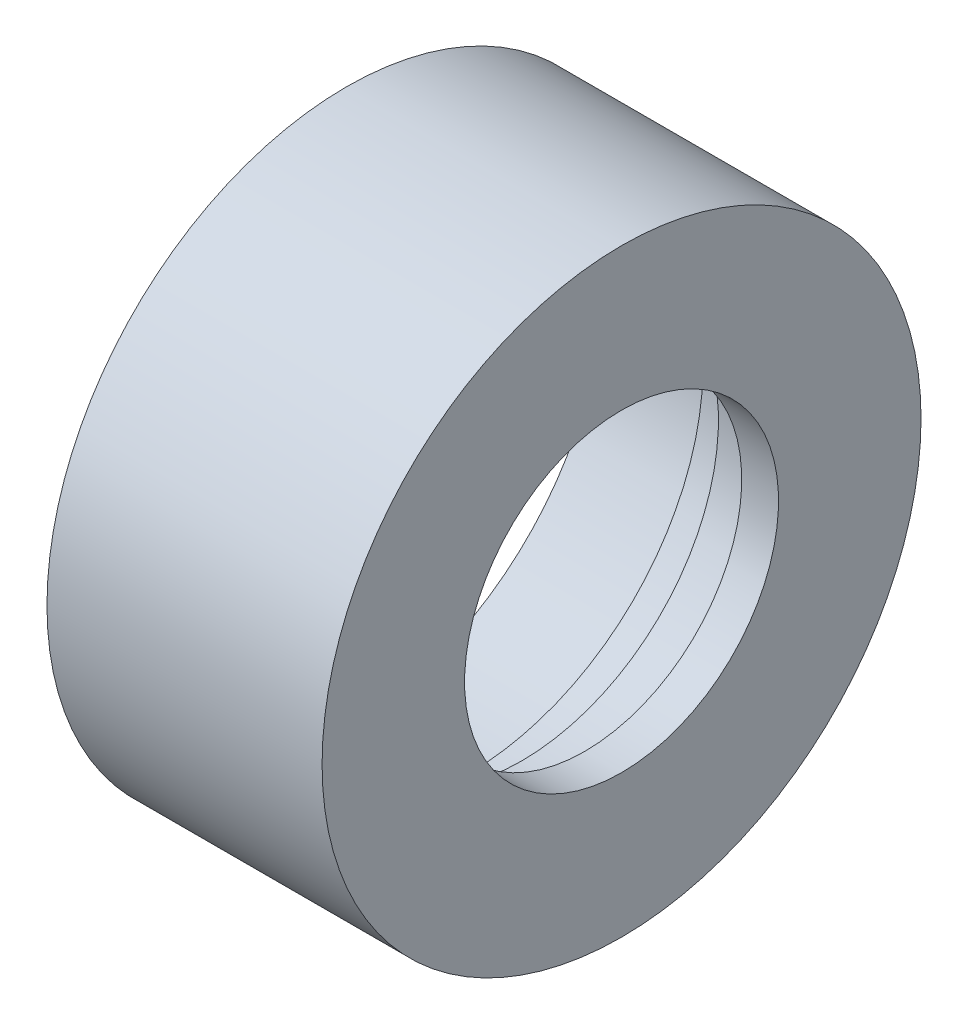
from build123d import *


with BuildPart() as part:
    # Sketch1 → Revolve1 (revolve)
    with BuildSketch(Plane.XY, mode=Mode.PRIVATE) as revolve1_sk:
        Polygon((-15.988687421, 110.683640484), (-23.979589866, 110.683640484), (-23.979589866, 115.509516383), (-30.779589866, 115.509516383), (-30.779589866, 118.279806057), (-46.279589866, 118.279806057), (-46.279589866, 123.758640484), (-11.279589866, 123.758640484), (-11.279589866, 105.630516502), (-15.963687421, 105.630516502), align=None)
    revolve(revolve1_sk.sketch.rotate(Axis((-44.556386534, 85.658640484, 0), (1, 0, 0)), 180), axis=Axis((-44.556386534, 85.658640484, 0), (1, 0, 0)))


solid = part.part
